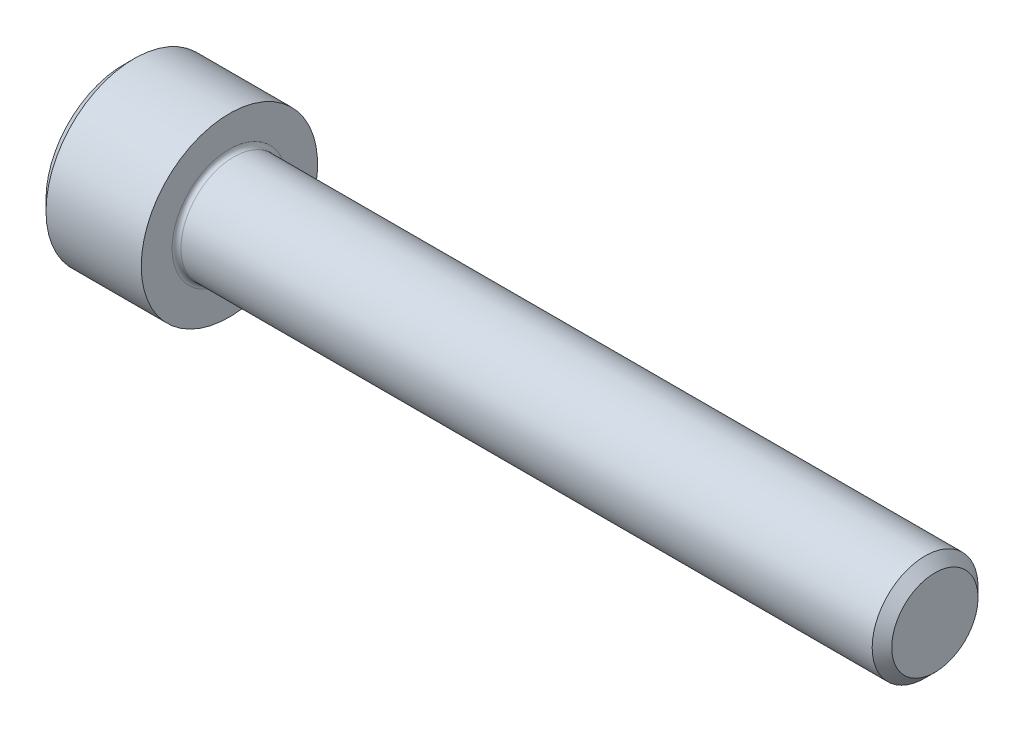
from build123d import *

# Parameters (mm, degrees)
FILLET1_R   = 0.25
HEX_2_DEPTH = 3


with BuildPart() as part:
    # BodySke → Base-Revolve (revolve)
    with BuildSketch(Plane.XY, mode=Mode.PRIVATE) as base_revolve_sk:
        Polygon((0, 0), (0, 4.4), (0.6, 5), (6, 5), (6, 3), (45.4455, 3), (46, 2.4455), (46, 0), align=None)
    revolve(base_revolve_sk.sketch.rotate(Axis((-31.75, 0, 0), (1, 0, 0)), 90), axis=Axis((-31.75, 0, 0), (1, 0, 0)))

    # Fillet1
    fillet1_edges = [part.edges().sort_by_distance(p)[0] for p in [
        (6, 0, -3),
    ]]
    fillet(fillet1_edges, radius=FILLET1_R)

    # Sketch2 → Hex-PreBroach (revolve, cut)
    with BuildSketch(Plane.XY, mode=Mode.PRIVATE) as hex_prebroach_sk:
        Polygon((0, 2.542), (3, 2.542), (4.467624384, 0), (0, 0), align=None)
    revolve(hex_prebroach_sk.sketch.rotate(Axis((0, 0, 0), (1, 0, 0)), 90), axis=Axis((0, 0, 0), (1, 0, 0)), mode=Mode.SUBTRACT)

    # Sketch3 → Hex 2 (cut)
    with BuildSketch(Plane(origin=(0, 0, 0), x_dir=(0, 0.500000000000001, 0.866025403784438), z_dir=(-1, 0, 0))):
        Polygon((1.467624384, 2.542), (-1.467624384, 2.542), (-2.935248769, 0), (-1.467624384, -2.542), (1.467624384, -2.542), (2.935248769, 0), align=None)
    extrude(amount=-HEX_2_DEPTH, mode=Mode.SUBTRACT)


solid = part.part
